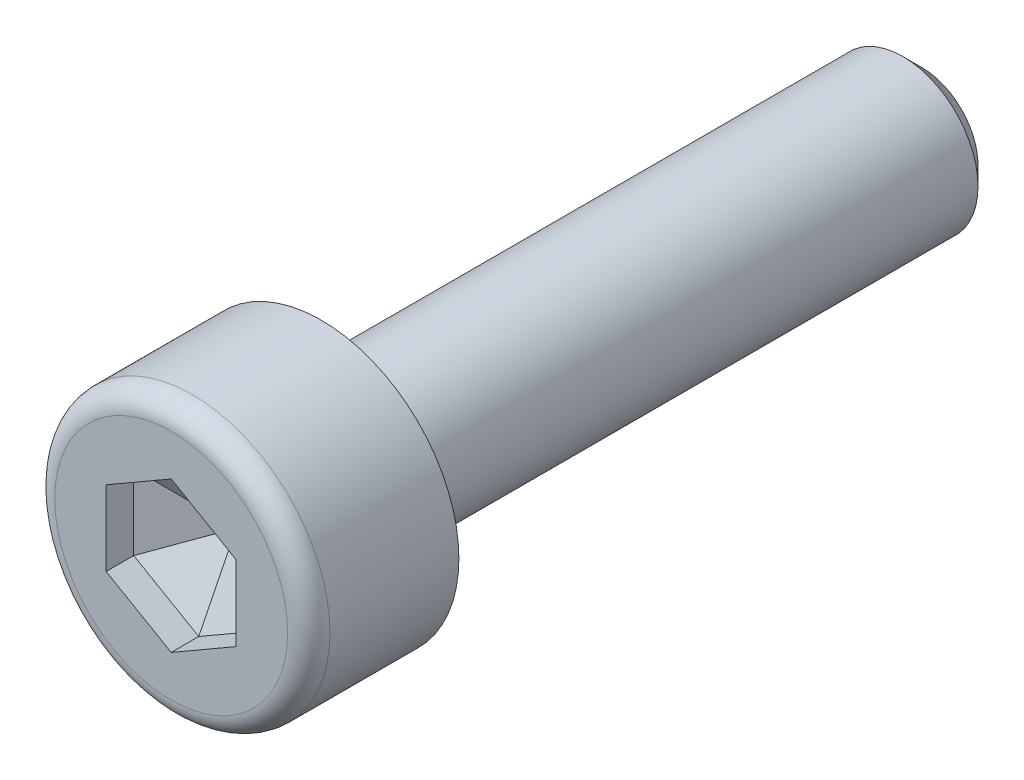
from build123d import *
from OCP.BRepFilletAPI import BRepFilletAPI_MakeChamfer

# Parameters (mm, degrees)
SKETCH_1_R          = 2.75
EXTRUDE_1_DEPTH     = 3
CUT_EXTRUDE_1_DEPTH = 1.3
SKETCH_3_R          = 1.5
EXTRUDE_2_DEPTH     = 12
CHAMFER_1_SIZE      = 0.375
FILLET_1_R          = 0.423076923
CHAMFER_2_SIZE      = 0.749279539
CHAMFER_2_SIZE2     = 1.29779023
FILLET_2_R          = 0.1


with BuildPart() as part:
    # Sketch 1 → Extrude 1 (new body)
    with BuildSketch(Plane.XY):
        Circle(SKETCH_1_R)
    extrude(amount=EXTRUDE_1_DEPTH)

    # Sketch 2 → Cut-Extrude 1 (cut)
    with BuildSketch(Plane.XY.offset(3)):
        Polygon((1.3, 0.75055535), (0, 1.5011107), (-1.3, 0.75055535), (-1.3, -0.75055535), (0, -1.5011107), (1.3, -0.75055535), align=None)
    extrude(amount=-CUT_EXTRUDE_1_DEPTH, mode=Mode.SUBTRACT)

    # Sketch 3 → Extrude 2 (add)
    with BuildSketch(Plane(origin=(0, 0, 0), x_dir=(-1, 0, 0), z_dir=(0, 0, -1))):
        with Locations(Location((0, 0, 0), (0, 0, 180))):
            Circle(SKETCH_3_R)
    extrude(amount=EXTRUDE_2_DEPTH)

    # Chamfer 1
    chamfer_1_edges = [part.edges().sort_by_distance(p)[0] for p in [
        (-1.5, 0, -12),
    ]]
    chamfer(chamfer_1_edges, length=CHAMFER_1_SIZE)

    # Fillet 1
    fillet_1_edges = [part.edges().sort_by_distance(p)[0] for p in [
        (-2.75, 0, 3),
    ]]
    fillet(fillet_1_edges, radius=FILLET_1_R)

    # Chamfer 2: one chamfer whose edges measure the first distance from different faces: ONE call of the kernel's chamfer builder (chamfer() names one face for all edges)
    chamfer_2_edges_1 = [part.edges().sort_by_distance(p)[0] for p in [
        (-0.65, 1.125833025, 1.7),
    ]]
    chamfer_2_side_1 = [part.faces().sort_by_distance(p)[0] for p in [
        (-0.65, 1.125833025, 2.35),
    ]]
    chamfer_2_edges_2 = [part.edges().sort_by_distance(p)[0] for p in [
        (0.65, 1.125833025, 1.7),
    ]]
    chamfer_2_side_2 = [part.faces().sort_by_distance(p)[0] for p in [
        (0.65, 1.125833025, 2.35),
    ]]
    chamfer_2_edges_3 = [part.edges().sort_by_distance(p)[0] for p in [
        (1.3, 0, 1.7),
    ]]
    chamfer_2_side_3 = [part.faces().sort_by_distance(p)[0] for p in [
        (1.3, 0, 2.35),
    ]]
    chamfer_2_edges_4 = [part.edges().sort_by_distance(p)[0] for p in [
        (0.65, -1.125833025, 1.7),
    ]]
    chamfer_2_side_4 = [part.faces().sort_by_distance(p)[0] for p in [
        (0.65, -1.125833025, 2.35),
    ]]
    chamfer_2_edges_5 = [part.edges().sort_by_distance(p)[0] for p in [
        (-0.65, -1.125833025, 1.7),
    ]]
    chamfer_2_side_5 = [part.faces().sort_by_distance(p)[0] for p in [
        (-0.65, -1.125833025, 2.35),
    ]]
    chamfer_2_edges_6 = [part.edges().sort_by_distance(p)[0] for p in [
        (-1.3, 0, 1.7),
    ]]
    chamfer_2_side_6 = [part.faces().sort_by_distance(p)[0] for p in [
        (-1.3, 0, 2.35),
    ]]
    chamfer_2 = BRepFilletAPI_MakeChamfer(part.part.solid().wrapped)
    for e in chamfer_2_edges_1:
        chamfer_2.Add(CHAMFER_2_SIZE, CHAMFER_2_SIZE2, e.wrapped, chamfer_2_side_1[0].wrapped)  # the first distance lies on this face
    for e in chamfer_2_edges_2:
        chamfer_2.Add(CHAMFER_2_SIZE, CHAMFER_2_SIZE2, e.wrapped, chamfer_2_side_2[0].wrapped)  # the first distance lies on this face
    for e in chamfer_2_edges_3:
        chamfer_2.Add(CHAMFER_2_SIZE, CHAMFER_2_SIZE2, e.wrapped, chamfer_2_side_3[0].wrapped)  # the first distance lies on this face
    for e in chamfer_2_edges_4:
        chamfer_2.Add(CHAMFER_2_SIZE, CHAMFER_2_SIZE2, e.wrapped, chamfer_2_side_4[0].wrapped)  # the first distance lies on this face
    for e in chamfer_2_edges_5:
        chamfer_2.Add(CHAMFER_2_SIZE, CHAMFER_2_SIZE2, e.wrapped, chamfer_2_side_5[0].wrapped)  # the first distance lies on this face
    for e in chamfer_2_edges_6:
        chamfer_2.Add(CHAMFER_2_SIZE, CHAMFER_2_SIZE2, e.wrapped, chamfer_2_side_6[0].wrapped)  # the first distance lies on this face
    add(Compound.cast(chamfer_2.Shape()), mode=Mode.REPLACE)

    # Fillet 2
    fillet_2_edges = [part.edges().sort_by_distance(p)[0] for p in [
        (-1.5, 0, 0),
    ]]
    fillet(fillet_2_edges, radius=FILLET_2_R)


solid = part.part
